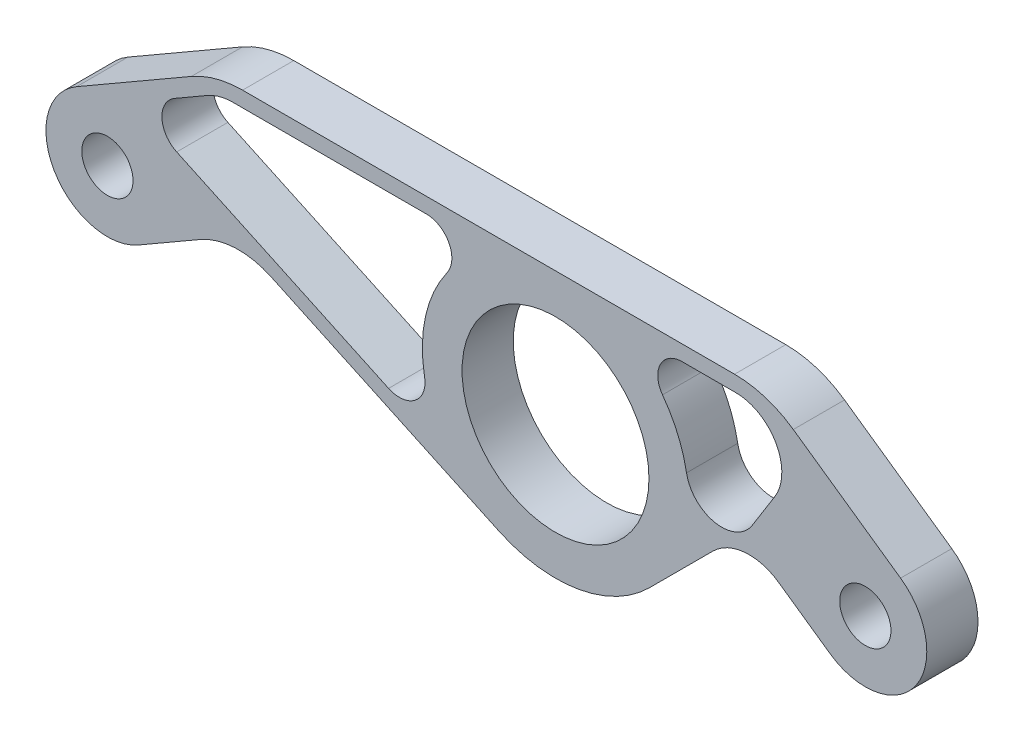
from build123d import *

# Parameters (mm, degrees)
BOSS_EXTRU_1_DEPTH      = 10
ESQUISSE2_R             = 5
ESQUISSE2_R_2           = 18.25
ENL_V_MAT_EXTRU_1_DEPTH = 104.325940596


with BuildPart() as part:
    # Esquisse1 → Boss.-Extru.1 (new body)
    with BuildSketch(Plane.XY):
        with BuildLine():
            Line((-61.107695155, 26), (34.96627994, 26))
            ThreePointArc((34.96627994, 26), (40.98039593, 25.074339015), (46.437808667, 22.383040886))
            Line((46.437808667, 22.383040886), (67.382917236, 7.717117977))
            ThreePointArc((67.382917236, 7.717117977), (70.329824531, -8.99562379), (53.617082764, -11.942531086))
            Line((53.617082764, -11.942531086), (43.557321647, -4.898610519))
            ThreePointArc((43.557321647, -4.898610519), (36.949999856, -3.128183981), (30.750489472, -6.01906315))
            Line((30.750489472, -6.01906315), (18.384776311, -18.384776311))
            ThreePointArc((18.384776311, -18.384776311), (4.514852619, -25.605001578), (-10.988074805, -23.564002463))
            Line((-10.988074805, -23.564002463), (-55.53897852, -2.789574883))
            ThreePointArc((-55.53897852, -2.789574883), (-62.532543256, -1.398468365), (-69.378252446, -3.393810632))
            Line((-69.378252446, -3.393810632), (-81.5, -10.392304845))
            ThreePointArc((-81.5, -10.392304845), (-97.892304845, -6), (-93.5, 10.392304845))
            Line((-93.5, 10.392304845), (-71.107695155, 23.320508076))
            ThreePointArc((-71.107695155, 23.320508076), (-66.284076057, 25.318516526), (-61.107695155, 26))
        make_face()
    extrude(amount=BOSS_EXTRU_1_DEPTH)

    # Esquisse2 → Enl_v. mat.-Extru.1 (cut, through all)
    with BuildSketch(Plane.XY.offset(10)):
        with BuildLine():
            Line((-25.238858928, 23), (-62.983339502, 23))
            ThreePointArc((-62.983339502, 23), (-65.571529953, 22.659258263), (-67.983339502, 21.660254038))
            Line((-67.983339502, 21.660254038), (-74.3604739, 17.978413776))
            ThreePointArc((-74.3604739, 17.978413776), (-76.855715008, 13.43018982), (-73.973565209, 9.116747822))
            Line((-73.973565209, 9.116747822), (-32.594394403, -10.178676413))
            ThreePointArc((-32.594394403, -10.178676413), (-27.420357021, -9.600693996), (-25.564963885, -4.736308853))
            ThreePointArc((-25.564963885, -4.736308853), (-25.383696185, 5.627429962), (-21.16807523, 15.096774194))
            ThreePointArc((-21.16807523, 15.096774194), (-20.793854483, 20.289527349), (-25.238858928, 23))
        make_face()
        with Locations((-87.5, 0)):
            Circle(ESQUISSE2_R)
        Circle(ESQUISSE2_R_2)
        with BuildLine():
            Line((35.192909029, 23), (24.677934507, 23))
            ThreePointArc((24.677934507, 23), (20.467478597, 20.406227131), (20.890155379, 15.479063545))
            ThreePointArc((20.890155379, 15.479063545), (23.86304589, 10.322550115), (25.585325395, 4.625053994))
            ThreePointArc((25.585325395, 4.625053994), (31.153668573, -1.004152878), (38.410940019, 2.162300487))
            Line((38.410940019, 2.162300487), (42.826526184, 9.232622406))
            ThreePointArc((42.826526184, 9.232622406), (43.063944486, 18.364264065), (35.192909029, 23))
        make_face()
        with Locations((60.5, -2.112706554)):
            Circle(ESQUISSE2_R)
    extrude(amount=-ENL_V_MAT_EXTRU_1_DEPTH, mode=Mode.SUBTRACT)


solid = part.part
